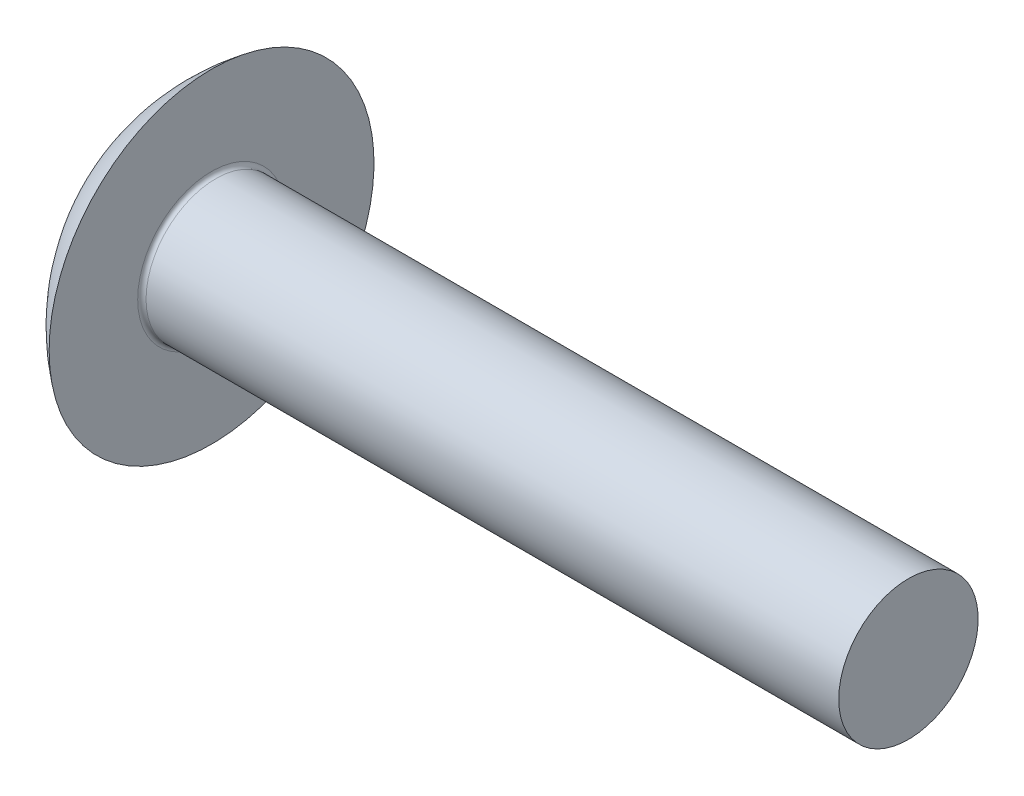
ISO-10303-21;
HEADER;
FILE_DESCRIPTION(('STEP AP214'),'2;1');
FILE_NAME('part.step','',(''),(''),'','','');
FILE_SCHEMA(('AUTOMOTIVE_DESIGN { 1 0 10303 214 1 1 1 1 }'));
ENDSEC;
DATA;
#1=APPLICATION_CONTEXT('core data for automotive mechanical design processes');
#2=APPLICATION_PROTOCOL_DEFINITION('international standard','automotive_design',2000,#1);
#3=PRODUCT_CONTEXT('',#1,'mechanical');
#4=PRODUCT('Part','Part','',(#3));
#5=PRODUCT_RELATED_PRODUCT_CATEGORY('part','',(#4));
#6=PRODUCT_DEFINITION_FORMATION('','',#4);
#7=PRODUCT_DEFINITION_CONTEXT('part definition',#1,'design');
#8=PRODUCT_DEFINITION('design','',#6,#7);
#9=PRODUCT_DEFINITION_SHAPE('','',#8);
#10=(LENGTH_UNIT() NAMED_UNIT(*) SI_UNIT(.MILLI.,.METRE.));
#11=(NAMED_UNIT(*) PLANE_ANGLE_UNIT() SI_UNIT($,.RADIAN.));
#12=(NAMED_UNIT(*) SI_UNIT($,.STERADIAN.) SOLID_ANGLE_UNIT());
#13=UNCERTAINTY_MEASURE_WITH_UNIT(LENGTH_MEASURE(1.E-05),#10,'distance_accuracy_value','');
#14=(GEOMETRIC_REPRESENTATION_CONTEXT(3) GLOBAL_UNCERTAINTY_ASSIGNED_CONTEXT((#13)) GLOBAL_UNIT_ASSIGNED_CONTEXT((#10,
#11,#12)) REPRESENTATION_CONTEXT('',''));
#15=CARTESIAN_POINT('',(0.,0.,0.));
#16=DIRECTION('',(0.,0.,1.));
#17=DIRECTION('',(1.,0.,0.));
#18=AXIS2_PLACEMENT_3D('',#15,#16,#17);
#19=CARTESIAN_POINT('',(55.87334750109,0.,0.));
#20=DIRECTION('',(-1.,0.,0.));
#21=DIRECTION('',(0.,0.,1.));
#22=AXIS2_PLACEMENT_3D('',#19,#20,#21);
#23=PLANE('',#22);
#24=CARTESIAN_POINT('',(55.87334750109,0.,0.));
#25=DIRECTION('',(-1.,0.,0.));
#26=DIRECTION('',(0.,0.,1.));
#27=AXIS2_PLACEMENT_3D('',#24,#25,#26);
#28=CIRCLE('',#27,5.00000000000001);
#29=CARTESIAN_POINT('',(55.87334750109,0.,5.00000000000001));
#30=VERTEX_POINT('',#29);
#31=EDGE_CURVE('E41',#30,#30,#28,.T.);
#32=ORIENTED_EDGE('',*,*,#31,.F.);
#33=EDGE_LOOP('',(#32));
#34=FACE_BOUND('',#33,.T.);
#35=ADVANCED_FACE('F30',(#34),#23,.F.);
#36=CARTESIAN_POINT('',(-81.1664804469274,0.,0.));
#37=DIRECTION('',(-1.,0.,0.));
#38=DIRECTION('',(0.,0.,1.));
#39=AXIS2_PLACEMENT_3D('',#36,#37,#38);
#40=CYLINDRICAL_SURFACE('',#39,5.);
#41=CARTESIAN_POINT('',(6.17334750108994,0.,0.));
#42=DIRECTION('',(-1.,0.,0.));
#43=DIRECTION('',(0.,0.,1.));
#44=AXIS2_PLACEMENT_3D('',#41,#42,#43);
#45=CIRCLE('',#44,5.);
#46=CARTESIAN_POINT('',(6.17334750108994,0.,5.));
#47=VERTEX_POINT('',#46);
#48=EDGE_CURVE('E10',#47,#47,#45,.F.);
#49=ORIENTED_EDGE('',*,*,#48,.T.);
#50=EDGE_LOOP('',(#49));
#51=FACE_BOUND('',#50,.T.);
#52=ORIENTED_EDGE('',*,*,#31,.T.);
#53=EDGE_LOOP('',(#52));
#54=FACE_BOUND('',#53,.T.);
#55=ADVANCED_FACE('F55',(#51,#54),#40,.T.);
#56=CARTESIAN_POINT('',(5.87334750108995,5.,0.));
#57=DIRECTION('',(-1.,0.,0.));
#58=DIRECTION('',(0.,0.,1.));
#59=AXIS2_PLACEMENT_3D('',#56,#57,#58);
#60=PLANE('',#59);
#61=CARTESIAN_POINT('',(5.87334750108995,0.,0.));
#62=DIRECTION('',(-1.,0.,0.));
#63=DIRECTION('',(0.,0.,1.));
#64=AXIS2_PLACEMENT_3D('',#61,#62,#63);
#65=CIRCLE('',#64,5.3);
#66=CARTESIAN_POINT('',(5.87334750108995,0.,5.3));
#67=VERTEX_POINT('',#66);
#68=EDGE_CURVE('E37',#67,#67,#65,.T.);
#69=ORIENTED_EDGE('',*,*,#68,.T.);
#70=EDGE_LOOP('',(#69));
#71=FACE_BOUND('',#70,.T.);
#72=CARTESIAN_POINT('',(5.87334750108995,0.,0.));
#73=DIRECTION('',(-1.,0.,0.));
#74=DIRECTION('',(0.,0.,1.));
#75=AXIS2_PLACEMENT_3D('',#72,#73,#74);
#76=CIRCLE('',#75,11.6546500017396);
#77=CARTESIAN_POINT('',(5.87334750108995,0.,11.6546500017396));
#78=VERTEX_POINT('',#77);
#79=EDGE_CURVE('E45',#78,#78,#76,.T.);
#80=ORIENTED_EDGE('',*,*,#79,.F.);
#81=EDGE_LOOP('',(#80));
#82=FACE_BOUND('',#81,.T.);
#83=ADVANCED_FACE('F53',(#71,#82),#60,.F.);
#84=CARTESIAN_POINT('',(14.5,0.,0.));
#85=DIRECTION('',(-1.,0.,0.));
#86=DIRECTION('',(0.,1.,0.));
#87=AXIS2_PLACEMENT_3D('',#84,#85,#86);
#88=SPHERICAL_SURFACE('',#87,14.5);
#89=ORIENTED_EDGE('',*,*,#79,.T.);
#90=EDGE_LOOP('',(#89));
#91=FACE_BOUND('',#90,.T.);
#92=ADVANCED_FACE('F51',(#91),#88,.T.);
#93=CARTESIAN_POINT('',(6.17334750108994,0.,0.));
#94=DIRECTION('',(-1.,0.,0.));
#95=DIRECTION('',(0.,0.,1.));
#96=AXIS2_PLACEMENT_3D('',#93,#94,#95);
#97=TOROIDAL_SURFACE('',#96,5.3,0.3);
#98=ORIENTED_EDGE('',*,*,#48,.F.);
#99=EDGE_LOOP('',(#98));
#100=FACE_BOUND('',#99,.T.);
#101=ORIENTED_EDGE('',*,*,#68,.F.);
#102=EDGE_LOOP('',(#101));
#103=FACE_BOUND('',#102,.T.);
#104=ADVANCED_FACE('F32',(#100,#103),#97,.F.);
#105=CLOSED_SHELL('',(#35,#55,#83,#92,#104));
#106=MANIFOLD_SOLID_BREP('B2',#105);
#107=ADVANCED_BREP_SHAPE_REPRESENTATION('',(#18,#106),#14);
#108=SHAPE_DEFINITION_REPRESENTATION(#9,#107);
ENDSEC;
END-ISO-10303-21;
